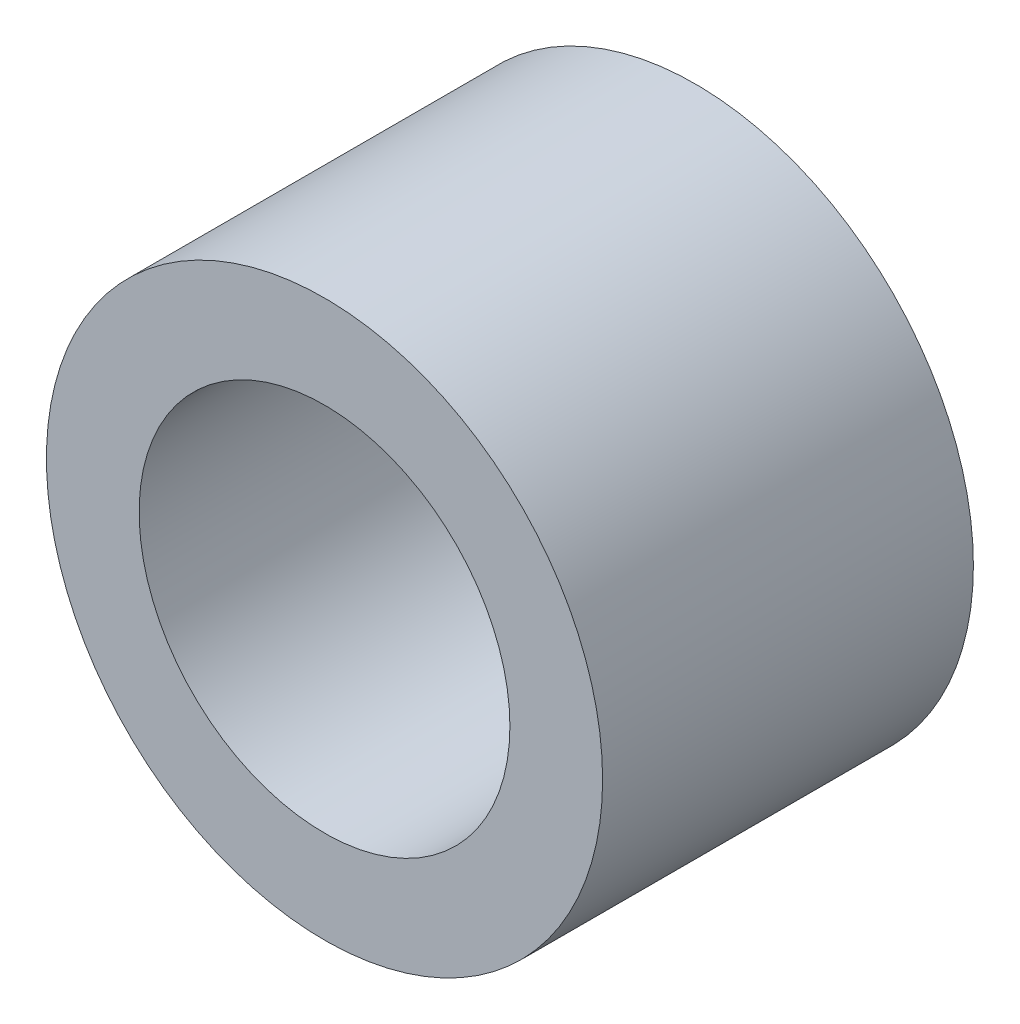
ISO-10303-21;
HEADER;
FILE_DESCRIPTION(('STEP AP214'),'2;1');
FILE_NAME('part.step','',(''),(''),'','','');
FILE_SCHEMA(('AUTOMOTIVE_DESIGN { 1 0 10303 214 1 1 1 1 }'));
ENDSEC;
DATA;
#1=APPLICATION_CONTEXT('core data for automotive mechanical design processes');
#2=APPLICATION_PROTOCOL_DEFINITION('international standard','automotive_design',2000,#1);
#3=PRODUCT_CONTEXT('',#1,'mechanical');
#4=PRODUCT('Part','Part','',(#3));
#5=PRODUCT_RELATED_PRODUCT_CATEGORY('part','',(#4));
#6=PRODUCT_DEFINITION_FORMATION('','',#4);
#7=PRODUCT_DEFINITION_CONTEXT('part definition',#1,'design');
#8=PRODUCT_DEFINITION('design','',#6,#7);
#9=PRODUCT_DEFINITION_SHAPE('','',#8);
#10=(LENGTH_UNIT() NAMED_UNIT(*) SI_UNIT(.MILLI.,.METRE.));
#11=(NAMED_UNIT(*) PLANE_ANGLE_UNIT() SI_UNIT($,.RADIAN.));
#12=(NAMED_UNIT(*) SI_UNIT($,.STERADIAN.) SOLID_ANGLE_UNIT());
#13=UNCERTAINTY_MEASURE_WITH_UNIT(LENGTH_MEASURE(1.E-05),#10,'distance_accuracy_value','');
#14=(GEOMETRIC_REPRESENTATION_CONTEXT(3) GLOBAL_UNCERTAINTY_ASSIGNED_CONTEXT((#13)) GLOBAL_UNIT_ASSIGNED_CONTEXT((#10,
#11,#12)) REPRESENTATION_CONTEXT('',''));
#15=CARTESIAN_POINT('',(0.,0.,0.));
#16=DIRECTION('',(0.,0.,1.));
#17=DIRECTION('',(1.,0.,0.));
#18=AXIS2_PLACEMENT_3D('',#15,#16,#17);
#19=CARTESIAN_POINT('',(0.,0.,11.9999999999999));
#20=DIRECTION('',(0.,0.,1.));
#21=DIRECTION('',(1.,0.,0.));
#22=AXIS2_PLACEMENT_3D('',#19,#20,#21);
#23=PLANE('',#22);
#24=CARTESIAN_POINT('',(0.,0.,11.9999999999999));
#25=DIRECTION('',(0.,0.,1.));
#26=DIRECTION('',(1.,0.,0.));
#27=AXIS2_PLACEMENT_3D('',#24,#25,#26);
#28=CIRCLE('',#27,9.);
#29=CARTESIAN_POINT('',(9.00000000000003,0.,11.9999999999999));
#30=VERTEX_POINT('',#29);
#31=EDGE_CURVE('E10',#30,#30,#28,.T.);
#32=ORIENTED_EDGE('',*,*,#31,.T.);
#33=EDGE_LOOP('',(#32));
#34=FACE_BOUND('',#33,.T.);
#35=CARTESIAN_POINT('',(0.,0.,11.9999999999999));
#36=DIRECTION('',(0.,0.,1.));
#37=DIRECTION('',(1.,0.,0.));
#38=AXIS2_PLACEMENT_3D('',#35,#36,#37);
#39=CIRCLE('',#38,6.);
#40=CARTESIAN_POINT('',(6.00000000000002,0.,11.9999999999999));
#41=VERTEX_POINT('',#40);
#42=EDGE_CURVE('E37',#41,#41,#39,.T.);
#43=ORIENTED_EDGE('',*,*,#42,.F.);
#44=EDGE_LOOP('',(#43));
#45=FACE_BOUND('',#44,.T.);
#46=ADVANCED_FACE('F26',(#34,#45),#23,.T.);
#47=CARTESIAN_POINT('',(0.,0.,-1.11022302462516E-13));
#48=DIRECTION('',(0.,0.,1.));
#49=DIRECTION('',(1.,0.,0.));
#50=AXIS2_PLACEMENT_3D('',#47,#48,#49);
#51=PLANE('',#50);
#52=CARTESIAN_POINT('',(0.,0.,-1.11022302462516E-13));
#53=DIRECTION('',(0.,0.,1.));
#54=DIRECTION('',(1.,0.,0.));
#55=AXIS2_PLACEMENT_3D('',#52,#53,#54);
#56=CIRCLE('',#55,9.);
#57=CARTESIAN_POINT('',(8.99999999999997,0.,-1.11022302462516E-13));
#58=VERTEX_POINT('',#57);
#59=EDGE_CURVE('E33',#58,#58,#56,.T.);
#60=ORIENTED_EDGE('',*,*,#59,.F.);
#61=EDGE_LOOP('',(#60));
#62=FACE_BOUND('',#61,.T.);
#63=CARTESIAN_POINT('',(0.,0.,-1.11022302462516E-13));
#64=DIRECTION('',(0.,0.,1.));
#65=DIRECTION('',(1.,0.,0.));
#66=AXIS2_PLACEMENT_3D('',#63,#64,#65);
#67=CIRCLE('',#66,6.);
#68=CARTESIAN_POINT('',(5.99999999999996,0.,-1.11022302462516E-13));
#69=VERTEX_POINT('',#68);
#70=EDGE_CURVE('E41',#69,#69,#67,.T.);
#71=ORIENTED_EDGE('',*,*,#70,.T.);
#72=EDGE_LOOP('',(#71));
#73=FACE_BOUND('',#72,.T.);
#74=ADVANCED_FACE('F47',(#62,#73),#51,.F.);
#75=CARTESIAN_POINT('',(0.,0.,11.9999999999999));
#76=DIRECTION('',(0.,0.,-1.));
#77=DIRECTION('',(-1.,0.,0.));
#78=AXIS2_PLACEMENT_3D('',#75,#76,#77);
#79=CYLINDRICAL_SURFACE('',#78,9.);
#80=ORIENTED_EDGE('',*,*,#31,.F.);
#81=EDGE_LOOP('',(#80));
#82=FACE_BOUND('',#81,.T.);
#83=ORIENTED_EDGE('',*,*,#59,.T.);
#84=EDGE_LOOP('',(#83));
#85=FACE_BOUND('',#84,.T.);
#86=ADVANCED_FACE('F28',(#82,#85),#79,.T.);
#87=CARTESIAN_POINT('',(0.,0.,11.9999999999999));
#88=DIRECTION('',(0.,0.,-1.));
#89=DIRECTION('',(-1.,0.,0.));
#90=AXIS2_PLACEMENT_3D('',#87,#88,#89);
#91=CYLINDRICAL_SURFACE('',#90,6.);
#92=ORIENTED_EDGE('',*,*,#42,.T.);
#93=EDGE_LOOP('',(#92));
#94=FACE_BOUND('',#93,.T.);
#95=ORIENTED_EDGE('',*,*,#70,.F.);
#96=EDGE_LOOP('',(#95));
#97=FACE_BOUND('',#96,.T.);
#98=ADVANCED_FACE('F49',(#94,#97),#91,.F.);
#99=CLOSED_SHELL('',(#46,#74,#86,#98));
#100=MANIFOLD_SOLID_BREP('B2',#99);
#101=ADVANCED_BREP_SHAPE_REPRESENTATION('',(#18,#100),#14);
#102=SHAPE_DEFINITION_REPRESENTATION(#9,#101);
ENDSEC;
END-ISO-10303-21;
